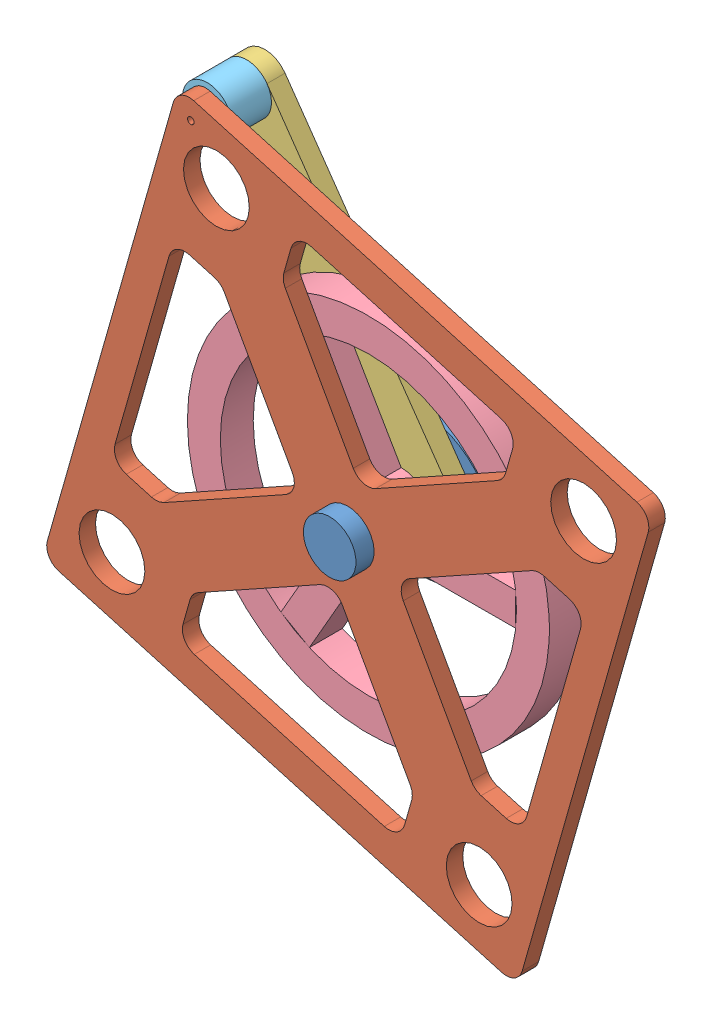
SolidWorks assembly Assemblage1.sldasm, configuration Défaut (file format 10000). Lengths in mm.
Overall size (185.31 188.55 50).
5 component instances, 5 part files, 8 mates.
Components (placement in the parent):
- moteur-1: moteur.SLDPRT [Défaut] at (-7.1103 -12.9886 40) size (43.2 43.2 50)
- body-1: body.SLDPRT [Défaut] at (-7.1103 -12.9886 79.5) x (0.961849 -0.27358 0) z (0 0 1) size (150 150 5)
- porte-moteur-1: porte-moteur.SLDPRT [Défaut] at (-7.1103 -12.9886 62) x (0.188333 0.982105 0) z (0 0 1) size (100.1 87.96 5.5)
- volant-1: volant.SLDPRT [Défaut] at (-7.1103 -12.9886 68.2327) x (0.999996 0.00273 0) z (0 0 1) size (110 110 10)
- petite pièce-1: petite pièce.SLDPRT [Défaut] at (-54.8049 72.6223 67.5) x (0.512457 0.858713 0) z (0 0 1) size (15 15 12)
Mates (geometry in assembly coordinates):
- Coaxiale1: concentric aligned: cylinder of moteur-1 through (-7.1103 -12.9886 90) axis (0 0 -1) radius 8; cylinder of body-1 through (-7.1103 -12.9886 84.5) axis (0 0 -1) radius 8
- Coaxiale2: concentric aligned: cylinder of moteur-1 through (-7.1103 -12.9886 90) axis (0 0 -1) radius 8; cylinder of porte-moteur-1 through (-7.1103 -12.9886 67.5) axis (0 0 -1) radius 8
- Coaxiale3: concentric aligned: cylinder of moteur-1 through (-7.1103 -12.9886 90) axis (0 0 -1) radius 8; cylinder of volant-1 through (-7.1103 -12.9886 78.2327) axis (0 0 -1) radius 8
- Coaxiale4: concentric aligned: cylinder of body-1 through (-54.8049 72.6223 84.5) axis (0 0 -1) radius 1; cylinder of porte-moteur-1 through (-54.8049 72.6223 67.5) axis (0 0 -1) radius 1
- Coïncidente1: coincident anti-aligned: plane of moteur-1 through (-7.1103 -12.9886 62) normal (0 0 1); plane of porte-moteur-1 through (-7.1103 -12.9886 62) normal (0 0 -1)
- Coaxiale5: concentric aligned: cylinder of body-1 through (-54.8049 72.6223 84.5) axis (0 0 -1) radius 1; cylinder of petite pièce-1 through (-54.8049 72.6223 79.5) axis (0 0 -1) radius 1
- Coïncidente2: coincident anti-aligned: plane of porte-moteur-1 through (-7.1103 -12.9886 67.5) normal (0 0 1); plane of petite pièce-1 through (-54.8049 72.6223 67.5) normal (0 0 -1)
- Coïncidente3: coincident anti-aligned: plane of body-1 through (-55.2892 73.4915 79.5) normal (0 0 -1); plane of petite pièce-1 through (-54.8049 72.6223 79.5) normal (0 0 1)
